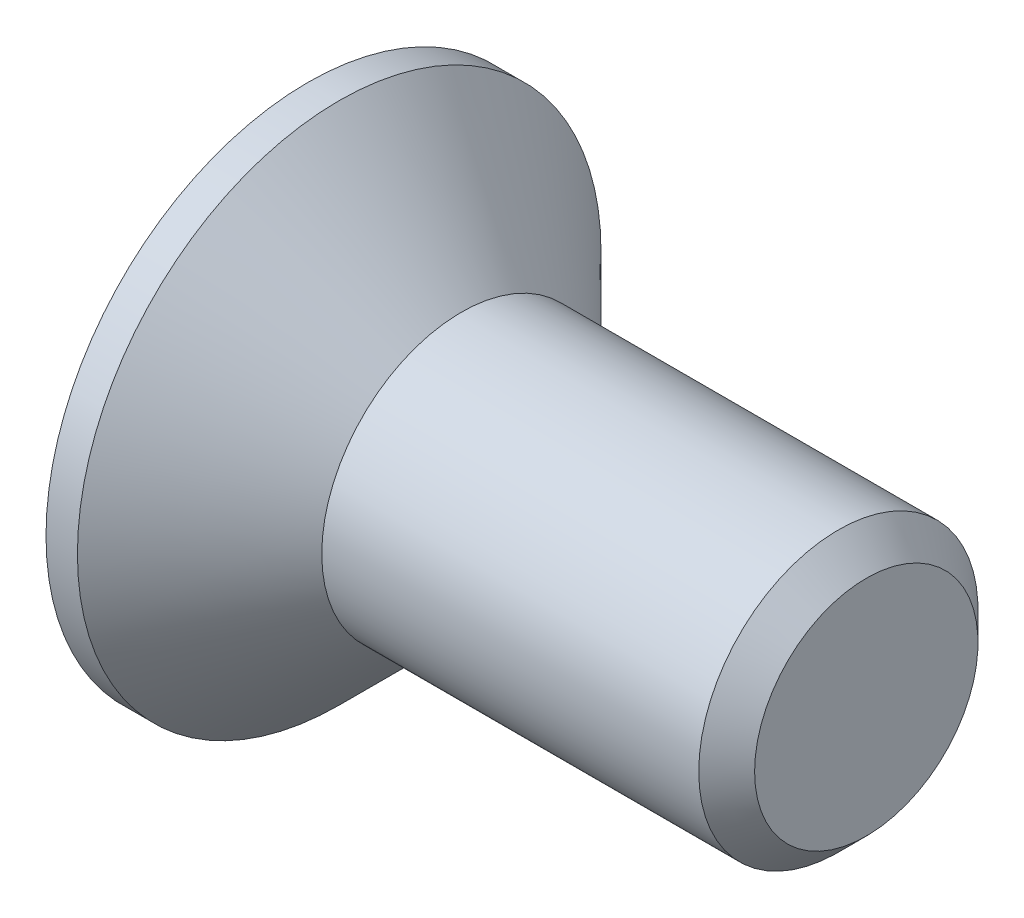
ISO-10303-21;
HEADER;
FILE_DESCRIPTION(('STEP AP214'),'2;1');
FILE_NAME('part.step','',(''),(''),'','','');
FILE_SCHEMA(('AUTOMOTIVE_DESIGN { 1 0 10303 214 1 1 1 1 }'));
ENDSEC;
DATA;
#1=APPLICATION_CONTEXT('core data for automotive mechanical design processes');
#2=APPLICATION_PROTOCOL_DEFINITION('international standard','automotive_design',2000,#1);
#3=PRODUCT_CONTEXT('',#1,'mechanical');
#4=PRODUCT('Part','Part','',(#3));
#5=PRODUCT_RELATED_PRODUCT_CATEGORY('part','',(#4));
#6=PRODUCT_DEFINITION_FORMATION('','',#4);
#7=PRODUCT_DEFINITION_CONTEXT('part definition',#1,'design');
#8=PRODUCT_DEFINITION('design','',#6,#7);
#9=PRODUCT_DEFINITION_SHAPE('','',#8);
#10=(LENGTH_UNIT() NAMED_UNIT(*) SI_UNIT(.MILLI.,.METRE.));
#11=(NAMED_UNIT(*) PLANE_ANGLE_UNIT() SI_UNIT($,.RADIAN.));
#12=(NAMED_UNIT(*) SI_UNIT($,.STERADIAN.) SOLID_ANGLE_UNIT());
#13=UNCERTAINTY_MEASURE_WITH_UNIT(LENGTH_MEASURE(1.E-05),#10,'distance_accuracy_value','');
#14=(GEOMETRIC_REPRESENTATION_CONTEXT(3) GLOBAL_UNCERTAINTY_ASSIGNED_CONTEXT((#13)) GLOBAL_UNIT_ASSIGNED_CONTEXT((#10,
#11,#12)) REPRESENTATION_CONTEXT('',''));
#15=CARTESIAN_POINT('',(0.,0.,0.));
#16=DIRECTION('',(0.,0.,1.));
#17=DIRECTION('',(1.,0.,0.));
#18=AXIS2_PLACEMENT_3D('',#15,#16,#17);
#19=CARTESIAN_POINT('',(0.,0.,0.));
#20=DIRECTION('',(-1.,0.,0.));
#21=DIRECTION('',(0.,0.,1.));
#22=AXIS2_PLACEMENT_3D('',#19,#20,#21);
#23=CONICAL_SURFACE('',#22,2.,0.78539816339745);
#24=CARTESIAN_POINT('',(-1.74999999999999,0.,0.));
#25=DIRECTION('',(-1.,0.,0.));
#26=DIRECTION('',(0.,0.,1.));
#27=AXIS2_PLACEMENT_3D('',#24,#25,#26);
#28=CIRCLE('',#27,3.75);
#29=CARTESIAN_POINT('',(-1.74999999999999,0.,3.75));
#30=VERTEX_POINT('',#29);
#31=EDGE_CURVE('E189',#30,#30,#28,.T.);
#32=ORIENTED_EDGE('',*,*,#31,.F.);
#33=EDGE_LOOP('',(#32));
#34=FACE_BOUND('',#33,.T.);
#35=CARTESIAN_POINT('',(0.,0.,0.));
#36=DIRECTION('',(-1.,0.,0.));
#37=DIRECTION('',(0.,0.,1.));
#38=AXIS2_PLACEMENT_3D('',#35,#36,#37);
#39=CIRCLE('',#38,2.);
#40=CARTESIAN_POINT('',(0.,0.,2.));
#41=VERTEX_POINT('',#40);
#42=EDGE_CURVE('E212',#41,#41,#39,.T.);
#43=ORIENTED_EDGE('',*,*,#42,.T.);
#44=EDGE_LOOP('',(#43));
#45=FACE_BOUND('',#44,.T.);
#46=ADVANCED_FACE('F33',(#34,#45),#23,.T.);
#47=CARTESIAN_POINT('',(-2.2,0.,0.));
#48=DIRECTION('',(-1.,0.,0.));
#49=DIRECTION('',(0.,0.,1.));
#50=AXIS2_PLACEMENT_3D('',#47,#48,#49);
#51=CYLINDRICAL_SURFACE('',#50,2.);
#52=CARTESIAN_POINT('',(5.4,0.,0.));
#53=DIRECTION('',(-1.,0.,0.));
#54=DIRECTION('',(0.,0.,1.));
#55=AXIS2_PLACEMENT_3D('',#52,#53,#54);
#56=CIRCLE('',#55,2.);
#57=CARTESIAN_POINT('',(5.4,0.,2.));
#58=VERTEX_POINT('',#57);
#59=EDGE_CURVE('E41',#58,#58,#56,.T.);
#60=ORIENTED_EDGE('',*,*,#59,.T.);
#61=EDGE_LOOP('',(#60));
#62=FACE_BOUND('',#61,.T.);
#63=ORIENTED_EDGE('',*,*,#42,.F.);
#64=EDGE_LOOP('',(#63));
#65=FACE_BOUND('',#64,.T.);
#66=ADVANCED_FACE('F217',(#62,#65),#51,.T.);
#67=CARTESIAN_POINT('',(5.8,0.,0.));
#68=DIRECTION('',(-1.,0.,0.));
#69=DIRECTION('',(0.,0.,1.));
#70=AXIS2_PLACEMENT_3D('',#67,#68,#69);
#71=PLANE('',#70);
#72=CARTESIAN_POINT('',(5.8,0.,0.));
#73=DIRECTION('',(-1.,0.,0.));
#74=DIRECTION('',(0.,0.,1.));
#75=AXIS2_PLACEMENT_3D('',#72,#73,#74);
#76=CIRCLE('',#75,1.6);
#77=CARTESIAN_POINT('',(5.8,0.,1.6));
#78=VERTEX_POINT('',#77);
#79=EDGE_CURVE('E11',#78,#78,#76,.F.);
#80=ORIENTED_EDGE('',*,*,#79,.T.);
#81=EDGE_LOOP('',(#80));
#82=FACE_BOUND('',#81,.T.);
#83=ADVANCED_FACE('F239',(#82),#71,.F.);
#84=CARTESIAN_POINT('',(-2.2,3.75,0.));
#85=DIRECTION('',(1.,0.,0.));
#86=DIRECTION('',(0.,0.,-1.));
#87=AXIS2_PLACEMENT_3D('',#84,#85,#86);
#88=PLANE('',#87);
#89=DIRECTION('',(0.,0.,-1.));
#90=VECTOR('',#89,1.);
#91=CARTESIAN_POINT('',(-2.2,0.55,-2.2));
#92=LINE('',#91,#90);
#93=CARTESIAN_POINT('',(-2.2,0.55,-0.55));
#94=VERTEX_POINT('',#93);
#95=CARTESIAN_POINT('',(-2.2,0.55,-2.2));
#96=VERTEX_POINT('',#95);
#97=EDGE_CURVE('E158',#94,#96,#92,.T.);
#98=ORIENTED_EDGE('',*,*,#97,.F.);
#99=DIRECTION('',(0.,-1.,0.));
#100=VECTOR('',#99,1.);
#101=CARTESIAN_POINT('',(-2.2,0.55,-0.55));
#102=LINE('',#101,#100);
#103=CARTESIAN_POINT('',(-2.2,2.2,-0.55));
#104=VERTEX_POINT('',#103);
#105=EDGE_CURVE('E48',#104,#94,#102,.T.);
#106=ORIENTED_EDGE('',*,*,#105,.F.);
#107=DIRECTION('',(0.,0.,-1.));
#108=VECTOR('',#107,1.);
#109=CARTESIAN_POINT('',(-2.2,2.2,-0.55));
#110=LINE('',#109,#108);
#111=CARTESIAN_POINT('',(-2.2,2.2,0.55));
#112=VERTEX_POINT('',#111);
#113=EDGE_CURVE('E185',#112,#104,#110,.T.);
#114=ORIENTED_EDGE('',*,*,#113,.F.);
#115=DIRECTION('',(0.,1.,0.));
#116=VECTOR('',#115,1.);
#117=CARTESIAN_POINT('',(-2.2,2.2,0.55));
#118=LINE('',#117,#116);
#119=CARTESIAN_POINT('',(-2.2,0.55,0.55));
#120=VERTEX_POINT('',#119);
#121=EDGE_CURVE('E183',#120,#112,#118,.T.);
#122=ORIENTED_EDGE('',*,*,#121,.F.);
#123=DIRECTION('',(0.,0.,-1.));
#124=VECTOR('',#123,1.);
#125=CARTESIAN_POINT('',(-2.2,0.55,0.55));
#126=LINE('',#125,#124);
#127=CARTESIAN_POINT('',(-2.2,0.55,2.2));
#128=VERTEX_POINT('',#127);
#129=EDGE_CURVE('E132',#128,#120,#126,.T.);
#130=ORIENTED_EDGE('',*,*,#129,.F.);
#131=DIRECTION('',(0.,1.,0.));
#132=VECTOR('',#131,1.);
#133=CARTESIAN_POINT('',(-2.2,0.55,2.2));
#134=LINE('',#133,#132);
#135=CARTESIAN_POINT('',(-2.2,-0.55,2.2));
#136=VERTEX_POINT('',#135);
#137=EDGE_CURVE('E179',#136,#128,#134,.T.);
#138=ORIENTED_EDGE('',*,*,#137,.F.);
#139=DIRECTION('',(0.,0.,1.));
#140=VECTOR('',#139,1.);
#141=CARTESIAN_POINT('',(-2.2,-0.55,2.2));
#142=LINE('',#141,#140);
#143=CARTESIAN_POINT('',(-2.2,-0.55,0.55));
#144=VERTEX_POINT('',#143);
#145=EDGE_CURVE('E176',#144,#136,#142,.T.);
#146=ORIENTED_EDGE('',*,*,#145,.F.);
#147=DIRECTION('',(0.,1.,0.));
#148=VECTOR('',#147,1.);
#149=CARTESIAN_POINT('',(-2.2,-0.55,0.55));
#150=LINE('',#149,#148);
#151=CARTESIAN_POINT('',(-2.2,-2.2,0.55));
#152=VERTEX_POINT('',#151);
#153=EDGE_CURVE('E173',#152,#144,#150,.T.);
#154=ORIENTED_EDGE('',*,*,#153,.F.);
#155=DIRECTION('',(0.,0.,1.));
#156=VECTOR('',#155,1.);
#157=CARTESIAN_POINT('',(-2.2,-2.2,0.55));
#158=LINE('',#157,#156);
#159=CARTESIAN_POINT('',(-2.2,-2.2,-0.55));
#160=VERTEX_POINT('',#159);
#161=EDGE_CURVE('E170',#160,#152,#158,.T.);
#162=ORIENTED_EDGE('',*,*,#161,.F.);
#163=DIRECTION('',(0.,-1.,0.));
#164=VECTOR('',#163,1.);
#165=CARTESIAN_POINT('',(-2.2,-2.2,-0.55));
#166=LINE('',#165,#164);
#167=CARTESIAN_POINT('',(-2.2,-0.55,-0.55));
#168=VERTEX_POINT('',#167);
#169=EDGE_CURVE('E167',#168,#160,#166,.T.);
#170=ORIENTED_EDGE('',*,*,#169,.F.);
#171=DIRECTION('',(0.,0.,1.));
#172=VECTOR('',#171,1.);
#173=CARTESIAN_POINT('',(-2.2,-0.55,-0.55));
#174=LINE('',#173,#172);
#175=CARTESIAN_POINT('',(-2.2,-0.55,-2.2));
#176=VERTEX_POINT('',#175);
#177=EDGE_CURVE('E164',#176,#168,#174,.T.);
#178=ORIENTED_EDGE('',*,*,#177,.F.);
#179=DIRECTION('',(0.,-1.,0.));
#180=VECTOR('',#179,1.);
#181=CARTESIAN_POINT('',(-2.2,-0.55,-2.2));
#182=LINE('',#181,#180);
#183=EDGE_CURVE('E161',#96,#176,#182,.T.);
#184=ORIENTED_EDGE('',*,*,#183,.F.);
#185=EDGE_LOOP('',(#98,#106,#114,#122,#130,#138,#146,#154,#162,#170,#178,#184));
#186=FACE_BOUND('',#185,.T.);
#187=CARTESIAN_POINT('',(-2.2,0.,0.));
#188=DIRECTION('',(-1.,0.,0.));
#189=DIRECTION('',(0.,0.,1.));
#190=AXIS2_PLACEMENT_3D('',#187,#188,#189);
#191=CIRCLE('',#190,3.75);
#192=CARTESIAN_POINT('',(-2.2,0.,3.75));
#193=VERTEX_POINT('',#192);
#194=EDGE_CURVE('E209',#193,#193,#191,.T.);
#195=ORIENTED_EDGE('',*,*,#194,.T.);
#196=EDGE_LOOP('',(#195));
#197=FACE_BOUND('',#196,.T.);
#198=ADVANCED_FACE('F230',(#186,#197),#88,.F.);
#199=CARTESIAN_POINT('',(-2.2,0.,0.));
#200=DIRECTION('',(-1.,0.,0.));
#201=DIRECTION('',(0.,0.,1.));
#202=AXIS2_PLACEMENT_3D('',#199,#200,#201);
#203=CYLINDRICAL_SURFACE('',#202,3.75);
#204=ORIENTED_EDGE('',*,*,#194,.F.);
#205=EDGE_LOOP('',(#204));
#206=FACE_BOUND('',#205,.T.);
#207=ORIENTED_EDGE('',*,*,#31,.T.);
#208=EDGE_LOOP('',(#207));
#209=FACE_BOUND('',#208,.T.);
#210=ADVANCED_FACE('F222',(#206,#209),#203,.T.);
#211=CARTESIAN_POINT('',(5.4,0.,0.));
#212=DIRECTION('',(-1.,0.,0.));
#213=DIRECTION('',(0.,0.,1.));
#214=AXIS2_PLACEMENT_3D('',#211,#212,#213);
#215=CONICAL_SURFACE('',#214,2.,0.78539816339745);
#216=ORIENTED_EDGE('',*,*,#79,.F.);
#217=EDGE_LOOP('',(#216));
#218=FACE_BOUND('',#217,.T.);
#219=ORIENTED_EDGE('',*,*,#59,.F.);
#220=EDGE_LOOP('',(#219));
#221=FACE_BOUND('',#220,.T.);
#222=ADVANCED_FACE('F35',(#218,#221),#215,.T.);
#223=CARTESIAN_POINT('',(-0.3,0.55,-0.55));
#224=DIRECTION('',(0.,0.,-1.));
#225=DIRECTION('',(-1.,0.,0.));
#226=AXIS2_PLACEMENT_3D('',#223,#224,#225);
#227=PLANE('',#226);
#228=ORIENTED_EDGE('',*,*,#105,.T.);
#229=DIRECTION('',(-1.,0.,0.));
#230=VECTOR('',#229,1.);
#231=CARTESIAN_POINT('',(-0.3,0.55,-0.55));
#232=LINE('',#231,#230);
#233=CARTESIAN_POINT('',(-0.3,0.55,-0.55));
#234=VERTEX_POINT('',#233);
#235=EDGE_CURVE('E96',#234,#94,#232,.T.);
#236=ORIENTED_EDGE('',*,*,#235,.F.);
#237=DIRECTION('',(0.,-1.,0.));
#238=VECTOR('',#237,1.);
#239=CARTESIAN_POINT('',(-0.3,0.55,-0.55));
#240=LINE('',#239,#238);
#241=CARTESIAN_POINT('',(-0.3,2.2,-0.55));
#242=VERTEX_POINT('',#241);
#243=EDGE_CURVE('E187',#242,#234,#240,.T.);
#244=ORIENTED_EDGE('',*,*,#243,.F.);
#245=DIRECTION('',(-1.,0.,0.));
#246=VECTOR('',#245,1.);
#247=CARTESIAN_POINT('',(-0.3,2.2,-0.55));
#248=LINE('',#247,#246);
#249=EDGE_CURVE('E56',#242,#104,#248,.T.);
#250=ORIENTED_EDGE('',*,*,#249,.T.);
#251=EDGE_LOOP('',(#228,#236,#244,#250));
#252=FACE_BOUND('',#251,.T.);
#253=ADVANCED_FACE('F221',(#252),#227,.F.);
#254=CARTESIAN_POINT('',(-0.3,2.2,-0.55));
#255=DIRECTION('',(0.,1.,0.));
#256=DIRECTION('',(-1.,0.,0.));
#257=AXIS2_PLACEMENT_3D('',#254,#255,#256);
#258=PLANE('',#257);
#259=ORIENTED_EDGE('',*,*,#113,.T.);
#260=ORIENTED_EDGE('',*,*,#249,.F.);
#261=DIRECTION('',(0.,0.,-1.));
#262=VECTOR('',#261,1.);
#263=CARTESIAN_POINT('',(-0.3,2.2,-0.55));
#264=LINE('',#263,#262);
#265=CARTESIAN_POINT('',(-0.3,2.2,0.55));
#266=VERTEX_POINT('',#265);
#267=EDGE_CURVE('E144',#266,#242,#264,.T.);
#268=ORIENTED_EDGE('',*,*,#267,.F.);
#269=DIRECTION('',(-1.,0.,0.));
#270=VECTOR('',#269,1.);
#271=CARTESIAN_POINT('',(-0.3,2.2,0.55));
#272=LINE('',#271,#270);
#273=EDGE_CURVE('E136',#266,#112,#272,.T.);
#274=ORIENTED_EDGE('',*,*,#273,.T.);
#275=EDGE_LOOP('',(#259,#260,#268,#274));
#276=FACE_BOUND('',#275,.T.);
#277=ADVANCED_FACE('F228',(#276),#258,.F.);
#278=CARTESIAN_POINT('',(-0.3,2.2,0.55));
#279=DIRECTION('',(0.,0.,1.));
#280=DIRECTION('',(1.,0.,0.));
#281=AXIS2_PLACEMENT_3D('',#278,#279,#280);
#282=PLANE('',#281);
#283=ORIENTED_EDGE('',*,*,#121,.T.);
#284=ORIENTED_EDGE('',*,*,#273,.F.);
#285=DIRECTION('',(0.,1.,0.));
#286=VECTOR('',#285,1.);
#287=CARTESIAN_POINT('',(-0.3,2.2,0.55));
#288=LINE('',#287,#286);
#289=CARTESIAN_POINT('',(-0.3,0.55,0.55));
#290=VERTEX_POINT('',#289);
#291=EDGE_CURVE('E140',#290,#266,#288,.T.);
#292=ORIENTED_EDGE('',*,*,#291,.F.);
#293=DIRECTION('',(-1.,0.,0.));
#294=VECTOR('',#293,1.);
#295=CARTESIAN_POINT('',(-0.3,0.55,0.55));
#296=LINE('',#295,#294);
#297=EDGE_CURVE('E125',#290,#120,#296,.T.);
#298=ORIENTED_EDGE('',*,*,#297,.T.);
#299=EDGE_LOOP('',(#283,#284,#292,#298));
#300=FACE_BOUND('',#299,.T.);
#301=ADVANCED_FACE('F141',(#300),#282,.F.);
#302=CARTESIAN_POINT('',(-0.3,0.55,0.55));
#303=DIRECTION('',(0.,1.,0.));
#304=DIRECTION('',(-1.,0.,0.));
#305=AXIS2_PLACEMENT_3D('',#302,#303,#304);
#306=PLANE('',#305);
#307=ORIENTED_EDGE('',*,*,#129,.T.);
#308=ORIENTED_EDGE('',*,*,#297,.F.);
#309=DIRECTION('',(0.,0.,-1.));
#310=VECTOR('',#309,1.);
#311=CARTESIAN_POINT('',(-0.3,0.55,0.55));
#312=LINE('',#311,#310);
#313=CARTESIAN_POINT('',(-0.3,0.55,2.2));
#314=VERTEX_POINT('',#313);
#315=EDGE_CURVE('E129',#314,#290,#312,.T.);
#316=ORIENTED_EDGE('',*,*,#315,.F.);
#317=DIRECTION('',(-1.,0.,0.));
#318=VECTOR('',#317,1.);
#319=CARTESIAN_POINT('',(-0.3,0.55,2.2));
#320=LINE('',#319,#318);
#321=EDGE_CURVE('E137',#314,#128,#320,.T.);
#322=ORIENTED_EDGE('',*,*,#321,.T.);
#323=EDGE_LOOP('',(#307,#308,#316,#322));
#324=FACE_BOUND('',#323,.T.);
#325=ADVANCED_FACE('F127',(#324),#306,.F.);
#326=CARTESIAN_POINT('',(-0.3,0.55,2.2));
#327=DIRECTION('',(0.,0.,1.));
#328=DIRECTION('',(1.,0.,0.));
#329=AXIS2_PLACEMENT_3D('',#326,#327,#328);
#330=PLANE('',#329);
#331=ORIENTED_EDGE('',*,*,#137,.T.);
#332=ORIENTED_EDGE('',*,*,#321,.F.);
#333=DIRECTION('',(0.,1.,0.));
#334=VECTOR('',#333,1.);
#335=CARTESIAN_POINT('',(-0.3,0.55,2.2));
#336=LINE('',#335,#334);
#337=CARTESIAN_POINT('',(-0.3,-0.55,2.2));
#338=VERTEX_POINT('',#337);
#339=EDGE_CURVE('E150',#338,#314,#336,.T.);
#340=ORIENTED_EDGE('',*,*,#339,.F.);
#341=DIRECTION('',(-1.,0.,0.));
#342=VECTOR('',#341,1.);
#343=CARTESIAN_POINT('',(-0.3,-0.55,2.2));
#344=LINE('',#343,#342);
#345=EDGE_CURVE('E192',#338,#136,#344,.T.);
#346=ORIENTED_EDGE('',*,*,#345,.T.);
#347=EDGE_LOOP('',(#331,#332,#340,#346));
#348=FACE_BOUND('',#347,.T.);
#349=ADVANCED_FACE('F277',(#348),#330,.F.);
#350=CARTESIAN_POINT('',(-0.3,-0.55,2.2));
#351=DIRECTION('',(0.,-1.,0.));
#352=DIRECTION('',(1.,0.,0.));
#353=AXIS2_PLACEMENT_3D('',#350,#351,#352);
#354=PLANE('',#353);
#355=ORIENTED_EDGE('',*,*,#145,.T.);
#356=ORIENTED_EDGE('',*,*,#345,.F.);
#357=DIRECTION('',(0.,0.,1.));
#358=VECTOR('',#357,1.);
#359=CARTESIAN_POINT('',(-0.3,-0.55,2.2));
#360=LINE('',#359,#358);
#361=CARTESIAN_POINT('',(-0.3,-0.55,0.55));
#362=VERTEX_POINT('',#361);
#363=EDGE_CURVE('E152',#362,#338,#360,.T.);
#364=ORIENTED_EDGE('',*,*,#363,.F.);
#365=DIRECTION('',(-1.,0.,0.));
#366=VECTOR('',#365,1.);
#367=CARTESIAN_POINT('',(-0.3,-0.55,0.55));
#368=LINE('',#367,#366);
#369=EDGE_CURVE('E194',#362,#144,#368,.T.);
#370=ORIENTED_EDGE('',*,*,#369,.T.);
#371=EDGE_LOOP('',(#355,#356,#364,#370));
#372=FACE_BOUND('',#371,.T.);
#373=ADVANCED_FACE('F273',(#372),#354,.F.);
#374=CARTESIAN_POINT('',(-0.3,-0.55,0.55));
#375=DIRECTION('',(0.,0.,1.));
#376=DIRECTION('',(1.,0.,0.));
#377=AXIS2_PLACEMENT_3D('',#374,#375,#376);
#378=PLANE('',#377);
#379=ORIENTED_EDGE('',*,*,#153,.T.);
#380=ORIENTED_EDGE('',*,*,#369,.F.);
#381=DIRECTION('',(0.,1.,0.));
#382=VECTOR('',#381,1.);
#383=CARTESIAN_POINT('',(-0.3,-0.55,0.55));
#384=LINE('',#383,#382);
#385=CARTESIAN_POINT('',(-0.3,-2.2,0.55));
#386=VERTEX_POINT('',#385);
#387=EDGE_CURVE('E422',#386,#362,#384,.T.);
#388=ORIENTED_EDGE('',*,*,#387,.F.);
#389=DIRECTION('',(-1.,0.,0.));
#390=VECTOR('',#389,1.);
#391=CARTESIAN_POINT('',(-0.3,-2.2,0.55));
#392=LINE('',#391,#390);
#393=EDGE_CURVE('E196',#386,#152,#392,.T.);
#394=ORIENTED_EDGE('',*,*,#393,.T.);
#395=EDGE_LOOP('',(#379,#380,#388,#394));
#396=FACE_BOUND('',#395,.T.);
#397=ADVANCED_FACE('F269',(#396),#378,.F.);
#398=CARTESIAN_POINT('',(-0.3,-2.2,0.55));
#399=DIRECTION('',(0.,-1.,0.));
#400=DIRECTION('',(1.,0.,0.));
#401=AXIS2_PLACEMENT_3D('',#398,#399,#400);
#402=PLANE('',#401);
#403=ORIENTED_EDGE('',*,*,#161,.T.);
#404=ORIENTED_EDGE('',*,*,#393,.F.);
#405=DIRECTION('',(0.,0.,1.));
#406=VECTOR('',#405,1.);
#407=CARTESIAN_POINT('',(-0.3,-2.2,0.55));
#408=LINE('',#407,#406);
#409=CARTESIAN_POINT('',(-0.3,-2.2,-0.55));
#410=VERTEX_POINT('',#409);
#411=EDGE_CURVE('E419',#410,#386,#408,.T.);
#412=ORIENTED_EDGE('',*,*,#411,.F.);
#413=DIRECTION('',(-1.,0.,0.));
#414=VECTOR('',#413,1.);
#415=CARTESIAN_POINT('',(-0.3,-2.2,-0.55));
#416=LINE('',#415,#414);
#417=EDGE_CURVE('E198',#410,#160,#416,.T.);
#418=ORIENTED_EDGE('',*,*,#417,.T.);
#419=EDGE_LOOP('',(#403,#404,#412,#418));
#420=FACE_BOUND('',#419,.T.);
#421=ADVANCED_FACE('F265',(#420),#402,.F.);
#422=CARTESIAN_POINT('',(-0.3,-2.2,-0.55));
#423=DIRECTION('',(0.,0.,-1.));
#424=DIRECTION('',(-1.,0.,0.));
#425=AXIS2_PLACEMENT_3D('',#422,#423,#424);
#426=PLANE('',#425);
#427=ORIENTED_EDGE('',*,*,#169,.T.);
#428=ORIENTED_EDGE('',*,*,#417,.F.);
#429=DIRECTION('',(0.,-1.,0.));
#430=VECTOR('',#429,1.);
#431=CARTESIAN_POINT('',(-0.3,-2.2,-0.55));
#432=LINE('',#431,#430);
#433=CARTESIAN_POINT('',(-0.3,-0.55,-0.55));
#434=VERTEX_POINT('',#433);
#435=EDGE_CURVE('E416',#434,#410,#432,.T.);
#436=ORIENTED_EDGE('',*,*,#435,.F.);
#437=DIRECTION('',(-1.,0.,0.));
#438=VECTOR('',#437,1.);
#439=CARTESIAN_POINT('',(-0.3,-0.55,-0.55));
#440=LINE('',#439,#438);
#441=EDGE_CURVE('E200',#434,#168,#440,.T.);
#442=ORIENTED_EDGE('',*,*,#441,.T.);
#443=EDGE_LOOP('',(#427,#428,#436,#442));
#444=FACE_BOUND('',#443,.T.);
#445=ADVANCED_FACE('F261',(#444),#426,.F.);
#446=CARTESIAN_POINT('',(-0.3,-0.55,-0.55));
#447=DIRECTION('',(0.,-1.,0.));
#448=DIRECTION('',(1.,0.,0.));
#449=AXIS2_PLACEMENT_3D('',#446,#447,#448);
#450=PLANE('',#449);
#451=ORIENTED_EDGE('',*,*,#177,.T.);
#452=ORIENTED_EDGE('',*,*,#441,.F.);
#453=DIRECTION('',(0.,0.,1.));
#454=VECTOR('',#453,1.);
#455=CARTESIAN_POINT('',(-0.3,-0.55,-0.55));
#456=LINE('',#455,#454);
#457=CARTESIAN_POINT('',(-0.3,-0.55,-2.2));
#458=VERTEX_POINT('',#457);
#459=EDGE_CURVE('E413',#458,#434,#456,.T.);
#460=ORIENTED_EDGE('',*,*,#459,.F.);
#461=DIRECTION('',(-1.,0.,0.));
#462=VECTOR('',#461,1.);
#463=CARTESIAN_POINT('',(-0.3,-0.55,-2.2));
#464=LINE('',#463,#462);
#465=EDGE_CURVE('E202',#458,#176,#464,.T.);
#466=ORIENTED_EDGE('',*,*,#465,.T.);
#467=EDGE_LOOP('',(#451,#452,#460,#466));
#468=FACE_BOUND('',#467,.T.);
#469=ADVANCED_FACE('F257',(#468),#450,.F.);
#470=CARTESIAN_POINT('',(-0.3,-0.55,-2.2));
#471=DIRECTION('',(0.,0.,-1.));
#472=DIRECTION('',(-1.,0.,0.));
#473=AXIS2_PLACEMENT_3D('',#470,#471,#472);
#474=PLANE('',#473);
#475=ORIENTED_EDGE('',*,*,#183,.T.);
#476=ORIENTED_EDGE('',*,*,#465,.F.);
#477=DIRECTION('',(0.,-1.,0.));
#478=VECTOR('',#477,1.);
#479=CARTESIAN_POINT('',(-0.3,-0.55,-2.2));
#480=LINE('',#479,#478);
#481=CARTESIAN_POINT('',(-0.3,0.55,-2.2));
#482=VERTEX_POINT('',#481);
#483=EDGE_CURVE('E408',#482,#458,#480,.T.);
#484=ORIENTED_EDGE('',*,*,#483,.F.);
#485=DIRECTION('',(-1.,0.,0.));
#486=VECTOR('',#485,1.);
#487=CARTESIAN_POINT('',(-0.3,0.55,-2.2));
#488=LINE('',#487,#486);
#489=EDGE_CURVE('E204',#482,#96,#488,.T.);
#490=ORIENTED_EDGE('',*,*,#489,.T.);
#491=EDGE_LOOP('',(#475,#476,#484,#490));
#492=FACE_BOUND('',#491,.T.);
#493=ADVANCED_FACE('F253',(#492),#474,.F.);
#494=CARTESIAN_POINT('',(-0.3,0.55,-2.2));
#495=DIRECTION('',(0.,1.,0.));
#496=DIRECTION('',(-1.,0.,0.));
#497=AXIS2_PLACEMENT_3D('',#494,#495,#496);
#498=PLANE('',#497);
#499=ORIENTED_EDGE('',*,*,#97,.T.);
#500=ORIENTED_EDGE('',*,*,#489,.F.);
#501=DIRECTION('',(0.,0.,-1.));
#502=VECTOR('',#501,1.);
#503=CARTESIAN_POINT('',(-0.3,0.55,-2.2));
#504=LINE('',#503,#502);
#505=EDGE_CURVE('E406',#234,#482,#504,.T.);
#506=ORIENTED_EDGE('',*,*,#505,.F.);
#507=ORIENTED_EDGE('',*,*,#235,.T.);
#508=EDGE_LOOP('',(#499,#500,#506,#507));
#509=FACE_BOUND('',#508,.T.);
#510=ADVANCED_FACE('F250',(#509),#498,.F.);
#511=CARTESIAN_POINT('',(-0.3,0.,0.));
#512=DIRECTION('',(1.,0.,0.));
#513=DIRECTION('',(0.,0.,-1.));
#514=AXIS2_PLACEMENT_3D('',#511,#512,#513);
#515=PLANE('',#514);
#516=ORIENTED_EDGE('',*,*,#243,.T.);
#517=ORIENTED_EDGE('',*,*,#505,.T.);
#518=ORIENTED_EDGE('',*,*,#483,.T.);
#519=ORIENTED_EDGE('',*,*,#459,.T.);
#520=ORIENTED_EDGE('',*,*,#435,.T.);
#521=ORIENTED_EDGE('',*,*,#411,.T.);
#522=ORIENTED_EDGE('',*,*,#387,.T.);
#523=ORIENTED_EDGE('',*,*,#363,.T.);
#524=ORIENTED_EDGE('',*,*,#339,.T.);
#525=ORIENTED_EDGE('',*,*,#315,.T.);
#526=ORIENTED_EDGE('',*,*,#291,.T.);
#527=ORIENTED_EDGE('',*,*,#267,.T.);
#528=EDGE_LOOP('',(#516,#517,#518,#519,#520,#521,#522,#523,#524,#525,#526,#527));
#529=FACE_BOUND('',#528,.T.);
#530=ADVANCED_FACE('F147',(#529),#515,.F.);
#531=CLOSED_SHELL('',(#46,#66,#83,#198,#210,#222,#253,#277,#301,#325,#349,#373,#397,#421,#445,
#469,#493,#510,#530));
#532=MANIFOLD_SOLID_BREP('B2',#531);
#533=ADVANCED_BREP_SHAPE_REPRESENTATION('',(#18,#532),#14);
#534=SHAPE_DEFINITION_REPRESENTATION(#9,#533);
ENDSEC;
END-ISO-10303-21;
